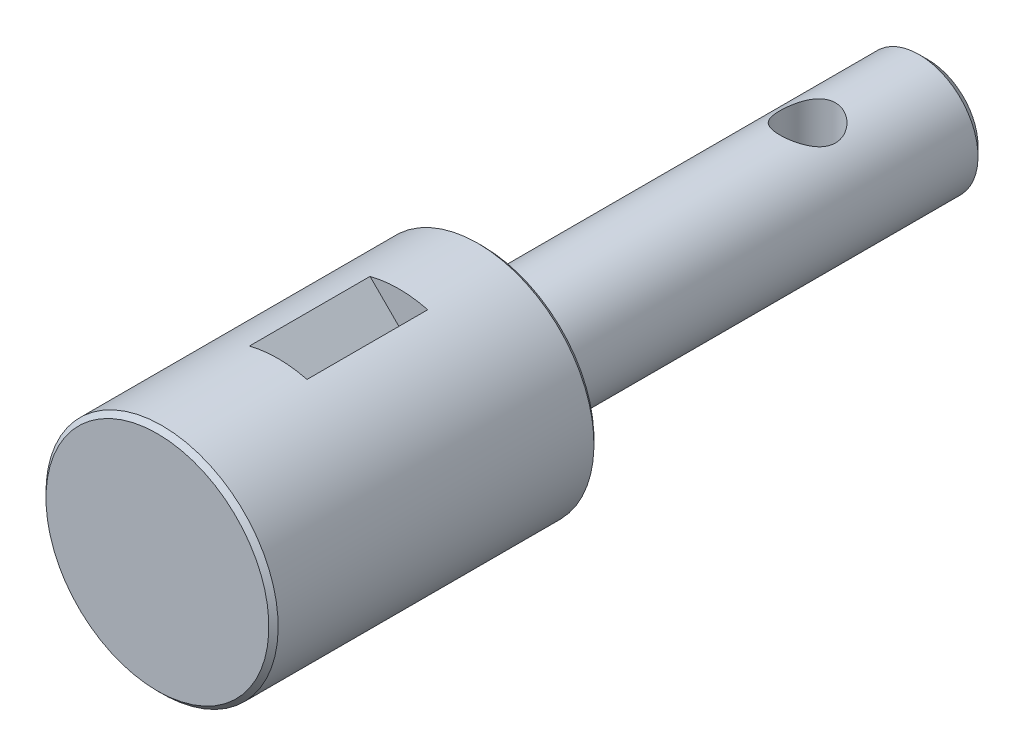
ISO-10303-21;
HEADER;
FILE_DESCRIPTION(('STEP AP214'),'2;1');
FILE_NAME('part.step','',(''),(''),'','','');
FILE_SCHEMA(('AUTOMOTIVE_DESIGN { 1 0 10303 214 1 1 1 1 }'));
ENDSEC;
DATA;
#1=APPLICATION_CONTEXT('core data for automotive mechanical design processes');
#2=APPLICATION_PROTOCOL_DEFINITION('international standard','automotive_design',2000,#1);
#3=PRODUCT_CONTEXT('',#1,'mechanical');
#4=PRODUCT('Part','Part','',(#3));
#5=PRODUCT_RELATED_PRODUCT_CATEGORY('part','',(#4));
#6=PRODUCT_DEFINITION_FORMATION('','',#4);
#7=PRODUCT_DEFINITION_CONTEXT('part definition',#1,'design');
#8=PRODUCT_DEFINITION('design','',#6,#7);
#9=PRODUCT_DEFINITION_SHAPE('','',#8);
#10=(LENGTH_UNIT() NAMED_UNIT(*) SI_UNIT(.MILLI.,.METRE.));
#11=(NAMED_UNIT(*) PLANE_ANGLE_UNIT() SI_UNIT($,.RADIAN.));
#12=(NAMED_UNIT(*) SI_UNIT($,.STERADIAN.) SOLID_ANGLE_UNIT());
#13=UNCERTAINTY_MEASURE_WITH_UNIT(LENGTH_MEASURE(1.E-05),#10,'distance_accuracy_value','');
#14=(GEOMETRIC_REPRESENTATION_CONTEXT(3) GLOBAL_UNCERTAINTY_ASSIGNED_CONTEXT((#13)) GLOBAL_UNIT_ASSIGNED_CONTEXT((#10,
#11,#12)) REPRESENTATION_CONTEXT('',''));
#15=CARTESIAN_POINT('',(0.,0.,0.));
#16=DIRECTION('',(0.,0.,1.));
#17=DIRECTION('',(1.,0.,0.));
#18=AXIS2_PLACEMENT_3D('',#15,#16,#17);
#19=CARTESIAN_POINT('',(0.,0.,-83.));
#20=DIRECTION('',(0.,0.,-1.));
#21=DIRECTION('',(0.,1.,0.));
#22=AXIS2_PLACEMENT_3D('',#19,#20,#21);
#23=CYLINDRICAL_SURFACE('',#22,12.5);
#24=CARTESIAN_POINT('',(0.,0.,-34.5));
#25=DIRECTION('',(0.,0.,-1.));
#26=DIRECTION('',(0.,1.,0.));
#27=AXIS2_PLACEMENT_3D('',#24,#25,#26);
#28=CIRCLE('',#27,12.5);
#29=CARTESIAN_POINT('',(0.,12.5,-34.5));
#30=VERTEX_POINT('',#29);
#31=EDGE_CURVE('E102',#30,#30,#28,.T.);
#32=ORIENTED_EDGE('',*,*,#31,.F.);
#33=EDGE_LOOP('',(#32));
#34=FACE_BOUND('',#33,.T.);
#35=CARTESIAN_POINT('',(0.,0.,-0.5));
#36=DIRECTION('',(0.,0.,-1.));
#37=DIRECTION('',(0.,1.,0.));
#38=AXIS2_PLACEMENT_3D('',#35,#36,#37);
#39=CIRCLE('',#38,12.5);
#40=CARTESIAN_POINT('',(0.,12.5,-0.5));
#41=VERTEX_POINT('',#40);
#42=EDGE_CURVE('E105',#41,#41,#39,.T.);
#43=ORIENTED_EDGE('',*,*,#42,.T.);
#44=EDGE_LOOP('',(#43));
#45=FACE_BOUND('',#44,.T.);
#46=DIRECTION('',(0.,0.,-1.));
#47=VECTOR('',#46,1.);
#48=CARTESIAN_POINT('',(-3.10756202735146,12.1075620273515,-83.));
#49=LINE('',#48,#47);
#50=CARTESIAN_POINT('',(-3.10756202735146,12.1075620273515,-26.));
#51=VERTEX_POINT('',#50);
#52=CARTESIAN_POINT('',(-3.10756202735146,12.1075620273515,-13.));
#53=VERTEX_POINT('',#52);
#54=EDGE_CURVE('E44',#51,#53,#49,.F.);
#55=ORIENTED_EDGE('',*,*,#54,.F.);
#56=CARTESIAN_POINT('',(0.,0.,-26.));
#57=DIRECTION('',(0.,0.,1.));
#58=DIRECTION('',(1.,0.,0.));
#59=AXIS2_PLACEMENT_3D('',#56,#57,#58);
#60=CIRCLE('',#59,12.5);
#61=CARTESIAN_POINT('',(3.10756202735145,12.1075620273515,-26.));
#62=VERTEX_POINT('',#61);
#63=EDGE_CURVE('E11',#51,#62,#60,.F.);
#64=ORIENTED_EDGE('',*,*,#63,.T.);
#65=DIRECTION('',(0.,0.,-1.));
#66=VECTOR('',#65,1.);
#67=CARTESIAN_POINT('',(3.10756202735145,12.1075620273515,-83.));
#68=LINE('',#67,#66);
#69=CARTESIAN_POINT('',(3.10756202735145,12.1075620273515,-13.));
#70=VERTEX_POINT('',#69);
#71=EDGE_CURVE('E60',#70,#62,#68,.T.);
#72=ORIENTED_EDGE('',*,*,#71,.F.);
#73=CARTESIAN_POINT('',(0.,0.,-13.));
#74=DIRECTION('',(0.,0.,1.));
#75=DIRECTION('',(1.,0.,0.));
#76=AXIS2_PLACEMENT_3D('',#73,#74,#75);
#77=CIRCLE('',#76,12.5);
#78=EDGE_CURVE('E111',#53,#70,#77,.F.);
#79=ORIENTED_EDGE('',*,*,#78,.F.);
#80=EDGE_LOOP('',(#55,#64,#72,#79));
#81=FACE_BOUND('',#80,.T.);
#82=ADVANCED_FACE('F31',(#34,#45,#81),#23,.T.);
#83=CARTESIAN_POINT('',(0.,0.,0.));
#84=DIRECTION('',(0.,0.,1.));
#85=DIRECTION('',(0.,-1.,0.));
#86=AXIS2_PLACEMENT_3D('',#83,#84,#85);
#87=PLANE('',#86);
#88=CARTESIAN_POINT('',(0.,0.,0.));
#89=DIRECTION('',(0.,0.,-1.));
#90=DIRECTION('',(0.,1.,0.));
#91=AXIS2_PLACEMENT_3D('',#88,#89,#90);
#92=CIRCLE('',#91,12.);
#93=CARTESIAN_POINT('',(0.,12.,0.));
#94=VERTEX_POINT('',#93);
#95=EDGE_CURVE('E108',#94,#94,#92,.T.);
#96=ORIENTED_EDGE('',*,*,#95,.F.);
#97=EDGE_LOOP('',(#96));
#98=FACE_BOUND('',#97,.T.);
#99=ADVANCED_FACE('F33',(#98),#87,.T.);
#100=CARTESIAN_POINT('',(0.,0.,-0.5));
#101=DIRECTION('',(0.,0.,-1.));
#102=DIRECTION('',(0.,1.,0.));
#103=AXIS2_PLACEMENT_3D('',#100,#101,#102);
#104=CONICAL_SURFACE('',#103,12.5,0.785398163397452);
#105=ORIENTED_EDGE('',*,*,#95,.T.);
#106=EDGE_LOOP('',(#105));
#107=FACE_BOUND('',#106,.T.);
#108=ORIENTED_EDGE('',*,*,#42,.F.);
#109=EDGE_LOOP('',(#108));
#110=FACE_BOUND('',#109,.T.);
#111=ADVANCED_FACE('F155',(#107,#110),#104,.T.);
#112=CARTESIAN_POINT('',(0.,0.,-35.));
#113=DIRECTION('',(0.,0.,1.));
#114=DIRECTION('',(0.,-1.,0.));
#115=AXIS2_PLACEMENT_3D('',#112,#113,#114);
#116=CONICAL_SURFACE('',#115,12.,0.785398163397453);
#117=ORIENTED_EDGE('',*,*,#31,.T.);
#118=EDGE_LOOP('',(#117));
#119=FACE_BOUND('',#118,.T.);
#120=CARTESIAN_POINT('',(0.,0.,-35.));
#121=DIRECTION('',(0.,0.,-1.));
#122=DIRECTION('',(0.,1.,0.));
#123=AXIS2_PLACEMENT_3D('',#120,#121,#122);
#124=CIRCLE('',#123,12.);
#125=CARTESIAN_POINT('',(0.,12.,-35.));
#126=VERTEX_POINT('',#125);
#127=EDGE_CURVE('E99',#126,#126,#124,.T.);
#128=ORIENTED_EDGE('',*,*,#127,.F.);
#129=EDGE_LOOP('',(#128));
#130=FACE_BOUND('',#129,.T.);
#131=ADVANCED_FACE('F160',(#119,#130),#116,.T.);
#132=CARTESIAN_POINT('',(0.,12.,-35.));
#133=DIRECTION('',(0.,0.,-1.));
#134=DIRECTION('',(0.,1.,0.));
#135=AXIS2_PLACEMENT_3D('',#132,#133,#134);
#136=PLANE('',#135);
#137=ORIENTED_EDGE('',*,*,#127,.T.);
#138=EDGE_LOOP('',(#137));
#139=FACE_BOUND('',#138,.T.);
#140=CARTESIAN_POINT('',(0.,0.,-35.));
#141=DIRECTION('',(0.,0.,-1.));
#142=DIRECTION('',(0.,1.,0.));
#143=AXIS2_PLACEMENT_3D('',#140,#141,#142);
#144=CIRCLE('',#143,6.34999999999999);
#145=CARTESIAN_POINT('',(0.,6.34999999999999,-35.));
#146=VERTEX_POINT('',#145);
#147=EDGE_CURVE('E96',#146,#146,#144,.T.);
#148=ORIENTED_EDGE('',*,*,#147,.F.);
#149=EDGE_LOOP('',(#148));
#150=FACE_BOUND('',#149,.T.);
#151=ADVANCED_FACE('F146',(#139,#150),#136,.T.);
#152=CARTESIAN_POINT('',(0.,0.,-83.));
#153=DIRECTION('',(0.,0.,-1.));
#154=DIRECTION('',(0.,1.,0.));
#155=AXIS2_PLACEMENT_3D('',#152,#153,#154);
#156=CYLINDRICAL_SURFACE('',#155,6.34999999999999);
#157=CARTESIAN_POINT('',(0.,6.34999999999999,-67.));
#158=CARTESIAN_POINT('',(0.158735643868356,6.34999131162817,-67.0000104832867));
#159=CARTESIAN_POINT('',(0.317696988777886,6.34398210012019,-67.0126737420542));
#160=CARTESIAN_POINT('',(0.630982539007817,6.32053556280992,-67.06280032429));
#161=CARTESIAN_POINT('',(0.78529595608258,6.30307351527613,-67.1003172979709));
#162=CARTESIAN_POINT('',(1.0842690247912,6.25856360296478,-67.1983909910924));
#163=CARTESIAN_POINT('',(1.22896239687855,6.23155157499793,-67.2588616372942));
#164=CARTESIAN_POINT('',(1.5059653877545,6.17047124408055,-67.4007104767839));
#165=CARTESIAN_POINT('',(1.63827688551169,6.1364040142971,-67.4820854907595));
#166=CARTESIAN_POINT('',(1.89506470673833,6.06218401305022,-67.6686289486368));
#167=CARTESIAN_POINT('',(2.01869357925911,6.02179791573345,-67.7748705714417));
#168=CARTESIAN_POINT('',(2.2471345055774,5.94033863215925,-68.0058035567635));
#169=CARTESIAN_POINT('',(2.35193384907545,5.8992650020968,-68.1305072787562));
#170=CARTESIAN_POINT('',(2.54682621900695,5.81791039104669,-68.4050648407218));
#171=CARTESIAN_POINT('',(2.63545600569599,5.77786853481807,-68.5560461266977));
#172=CARTESIAN_POINT('',(2.74809115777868,5.72470256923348,-68.7934763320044));
#173=CARTESIAN_POINT('',(2.78225974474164,5.70812542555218,-68.8744765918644));
#174=CARTESIAN_POINT('',(2.84348823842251,5.67787297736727,-69.0396280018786));
#175=CARTESIAN_POINT('',(2.87055214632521,5.66419604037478,-69.1237773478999));
#176=CARTESIAN_POINT('',(2.9159220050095,5.6409673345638,-69.2897986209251));
#177=CARTESIAN_POINT('',(2.93463412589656,5.63122717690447,-69.3715334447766));
#178=CARTESIAN_POINT('',(2.96517735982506,5.6152044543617,-69.5365762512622));
#179=CARTESIAN_POINT('',(2.9770119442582,5.60892014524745,-69.6198834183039));
#180=CARTESIAN_POINT('',(2.99363646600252,5.60006542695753,-69.7873623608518));
#181=CARTESIAN_POINT('',(2.99842966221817,5.59749329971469,-69.8715337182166));
#182=CARTESIAN_POINT('',(3.00091788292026,5.59615798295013,-70.0399844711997));
#183=CARTESIAN_POINT('',(2.99861346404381,5.59739449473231,-70.1242638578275));
#184=CARTESIAN_POINT('',(2.98228707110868,5.60612787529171,-70.3586473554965));
#185=CARTESIAN_POINT('',(2.96044454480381,5.61779971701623,-70.5081386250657));
#186=CARTESIAN_POINT('',(2.89501216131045,5.65178886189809,-70.80091706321));
#187=CARTESIAN_POINT('',(2.85141651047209,5.67410900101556,-70.9442025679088));
#188=CARTESIAN_POINT('',(2.74288007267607,5.72737541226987,-71.2246352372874));
#189=CARTESIAN_POINT('',(2.67746822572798,5.758509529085,-71.3615633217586));
#190=CARTESIAN_POINT('',(2.52750090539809,5.82588930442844,-71.6231136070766));
#191=CARTESIAN_POINT('',(2.44293700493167,5.86213721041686,-71.7477303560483));
#192=CARTESIAN_POINT('',(2.24603652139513,5.94055944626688,-71.9957713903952));
#193=CARTESIAN_POINT('',(2.13165370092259,5.98294371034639,-72.1175105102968));
#194=CARTESIAN_POINT('',(1.88382332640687,6.06553935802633,-72.3407340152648));
#195=CARTESIAN_POINT('',(1.75036848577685,6.10574990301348,-72.4422106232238));
#196=CARTESIAN_POINT('',(1.46180089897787,6.1813162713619,-72.6255310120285));
#197=CARTESIAN_POINT('',(1.30606552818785,6.21643476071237,-72.7065002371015));
#198=CARTESIAN_POINT('',(0.981099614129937,6.27591792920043,-72.8404697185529));
#199=CARTESIAN_POINT('',(0.811878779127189,6.30029026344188,-72.8934898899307));
#200=CARTESIAN_POINT('',(0.478650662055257,6.33397698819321,-72.9660934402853));
#201=CARTESIAN_POINT('',(0.315236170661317,6.34430139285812,-72.9879260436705));
#202=CARTESIAN_POINT('',(-0.0132401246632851,6.35210748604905,-73.0044690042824));
#203=CARTESIAN_POINT('',(-0.178301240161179,6.34959433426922,-72.9991902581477));
#204=CARTESIAN_POINT('',(-0.493581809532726,6.33262500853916,-72.963082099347));
#205=CARTESIAN_POINT('',(-0.644051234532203,6.31898607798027,-72.9340006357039));
#206=CARTESIAN_POINT('',(-0.93771982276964,6.28212499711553,-72.8537450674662));
#207=CARTESIAN_POINT('',(-1.08091814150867,6.25890173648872,-72.8025684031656));
#208=CARTESIAN_POINT('',(-1.36096532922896,6.20413258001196,-72.6780544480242));
#209=CARTESIAN_POINT('',(-1.49748886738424,6.17235515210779,-72.6040908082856));
#210=CARTESIAN_POINT('',(-1.75666682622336,6.103656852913,-72.4367891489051));
#211=CARTESIAN_POINT('',(-1.87931512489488,6.06673372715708,-72.3434426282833));
#212=CARTESIAN_POINT('',(-2.11888943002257,5.98749695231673,-72.1303196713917));
#213=CARTESIAN_POINT('',(-2.23431643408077,5.94499681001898,-72.0089239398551));
#214=CARTESIAN_POINT('',(-2.44375164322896,5.86202140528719,-71.7481599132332));
#215=CARTESIAN_POINT('',(-2.53774887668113,5.82154718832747,-71.6087824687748));
#216=CARTESIAN_POINT('',(-2.70463547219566,5.74596844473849,-71.3096827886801));
#217=CARTESIAN_POINT('',(-2.77667149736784,5.71110126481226,-71.149419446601));
#218=CARTESIAN_POINT('',(-2.89199593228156,5.65359008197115,-70.8168485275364));
#219=CARTESIAN_POINT('',(-2.93531709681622,5.63093215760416,-70.6445549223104));
#220=CARTESIAN_POINT('',(-2.98833110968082,5.60296296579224,-70.3097268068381));
#221=CARTESIAN_POINT('',(-3.0007349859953,5.59625585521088,-70.1477390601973));
#222=CARTESIAN_POINT('',(-2.99919821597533,5.5970815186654,-69.8239486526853));
#223=CARTESIAN_POINT('',(-2.98526553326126,5.6046099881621,-69.6621459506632));
#224=CARTESIAN_POINT('',(-2.93391097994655,5.63164218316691,-69.3562762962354));
#225=CARTESIAN_POINT('',(-2.8983673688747,5.65018584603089,-69.2117994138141));
#226=CARTESIAN_POINT('',(-2.80694513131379,5.69615317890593,-68.9309420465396));
#227=CARTESIAN_POINT('',(-2.75106038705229,5.72357952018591,-68.7945640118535));
#228=CARTESIAN_POINT('',(-2.61632375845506,5.78646860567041,-68.5237790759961));
#229=CARTESIAN_POINT('',(-2.53618984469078,5.8223450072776,-68.3901087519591));
#230=CARTESIAN_POINT('',(-2.35675969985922,5.89725587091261,-68.1372777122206));
#231=CARTESIAN_POINT('',(-2.25745430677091,5.93629183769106,-68.0181239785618));
#232=CARTESIAN_POINT('',(-2.0303859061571,6.01797799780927,-67.7848906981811));
#233=CARTESIAN_POINT('',(-1.9007384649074,6.06058247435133,-67.6726235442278));
#234=CARTESIAN_POINT('',(-1.62298549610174,6.14078504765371,-67.471105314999));
#235=CARTESIAN_POINT('',(-1.47487109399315,6.17838071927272,-67.3818653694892));
#236=CARTESIAN_POINT('',(-1.24202481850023,6.22785646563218,-67.2678129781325));
#237=CARTESIAN_POINT('',(-1.16272476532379,6.24318215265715,-67.2331244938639));
#238=CARTESIAN_POINT('',(-1.00102034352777,6.27113792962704,-67.1706082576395));
#239=CARTESIAN_POINT('',(-0.9186175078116,6.28376933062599,-67.1427771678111));
#240=CARTESIAN_POINT('',(-0.751519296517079,6.30593452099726,-67.0943552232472));
#241=CARTESIAN_POINT('',(-0.666829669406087,6.31547541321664,-67.073747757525));
#242=CARTESIAN_POINT('',(-0.495718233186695,6.33120329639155,-67.0399560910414));
#243=CARTESIAN_POINT('',(-0.409297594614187,6.33739247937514,-67.0267670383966));
#244=CARTESIAN_POINT('',(-0.268909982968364,6.34452974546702,-67.0115919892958));
#245=CARTESIAN_POINT('',(-0.21524263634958,6.34657804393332,-67.0072482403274));
#246=CARTESIAN_POINT('',(-0.107725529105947,6.34931466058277,-67.0014504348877));
#247=CARTESIAN_POINT('',(-0.053875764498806,6.35000294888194,-66.9999964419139));
#248=CARTESIAN_POINT('',(0.,6.34999999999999,-67.));
#249=B_SPLINE_CURVE_WITH_KNOTS('',3,(#157,#158,#159,#160,#161,#162,#163,#164,#165,#166,#167,
#168,#169,#170,#171,#172,#173,#174,#175,#176,#177,#178,#179,#180,#181,#182,#183,#184,#185,#186,
#187,#188,#189,#190,#191,#192,#193,#194,#195,#196,#197,#198,#199,#200,#201,#202,#203,#204,#205,
#206,#207,#208,#209,#210,#211,#212,#213,#214,#215,#216,#217,#218,#219,#220,#221,#222,#223,#224,
#225,#226,#227,#228,#229,#230,#231,#232,#233,#234,#235,#236,#237,#238,#239,#240,#241,#242,#243,
#244,#245,#246,#247,#248),.UNSPECIFIED.,.T.,.F.,(4,2,2,2,2,2,2,2,2,2,2,2,2,2,2,2,2,2,2,2,2,2,2,
2,2,2,2,2,2,2,2,2,2,2,2,2,2,2,2,2,2,2,2,2,2,4),(0.,0.475997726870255,0.953026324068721,
1.42828352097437,1.90346847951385,2.405132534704,2.90713396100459,3.44289983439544,
3.71097177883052,3.97889242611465,4.23178157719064,4.48454297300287,4.73718734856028,
4.98981191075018,5.44206841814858,5.89444544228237,6.35730164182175,6.82036189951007,
7.33510031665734,7.85003592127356,8.38419883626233,8.91798061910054,9.41089442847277,
9.9036101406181,10.3630820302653,10.8226071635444,11.2961009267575,11.7698027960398,
12.2859764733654,12.8024138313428,13.336915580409,13.8708065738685,14.3559144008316,
14.8408755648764,15.2887410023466,15.7367412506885,16.2145869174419,16.6926615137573,
17.2203903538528,17.7483737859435,18.0117778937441,18.275053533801,18.5377197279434,
18.8002139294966,18.9617666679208,19.1233229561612),.UNSPECIFIED.);
#250=CARTESIAN_POINT('',(0.,6.34999999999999,-67.));
#251=VERTEX_POINT('',#250);
#252=EDGE_CURVE('E35',#251,#251,#249,.T.);
#253=ORIENTED_EDGE('',*,*,#252,.F.);
#254=EDGE_LOOP('',(#253));
#255=FACE_BOUND('',#254,.T.);
#256=CARTESIAN_POINT('',(0.,-6.34999999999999,-67.));
#257=CARTESIAN_POINT('',(-0.158735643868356,-6.34999131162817,-67.0000104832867));
#258=CARTESIAN_POINT('',(-0.317696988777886,-6.34398210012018,-67.0126737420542));
#259=CARTESIAN_POINT('',(-0.630982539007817,-6.32053556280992,-67.06280032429));
#260=CARTESIAN_POINT('',(-0.78529595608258,-6.30307351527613,-67.1003172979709));
#261=CARTESIAN_POINT('',(-1.0842690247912,-6.25856360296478,-67.1983909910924));
#262=CARTESIAN_POINT('',(-1.22896239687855,-6.23155157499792,-67.2588616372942));
#263=CARTESIAN_POINT('',(-1.5059653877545,-6.17047124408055,-67.4007104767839));
#264=CARTESIAN_POINT('',(-1.63827688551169,-6.1364040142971,-67.4820854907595));
#265=CARTESIAN_POINT('',(-1.89506470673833,-6.06218401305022,-67.6686289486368));
#266=CARTESIAN_POINT('',(-2.01869357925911,-6.02179791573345,-67.7748705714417));
#267=CARTESIAN_POINT('',(-2.2471345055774,-5.94033863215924,-68.0058035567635));
#268=CARTESIAN_POINT('',(-2.35193384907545,-5.89926500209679,-68.1305072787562));
#269=CARTESIAN_POINT('',(-2.54682621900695,-5.81791039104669,-68.4050648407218));
#270=CARTESIAN_POINT('',(-2.63545600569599,-5.77786853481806,-68.5560461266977));
#271=CARTESIAN_POINT('',(-2.74809115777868,-5.72470256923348,-68.7934763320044));
#272=CARTESIAN_POINT('',(-2.78225974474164,-5.70812542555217,-68.8744765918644));
#273=CARTESIAN_POINT('',(-2.84348823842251,-5.67787297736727,-69.0396280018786));
#274=CARTESIAN_POINT('',(-2.87055214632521,-5.66419604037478,-69.1237773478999));
#275=CARTESIAN_POINT('',(-2.9159220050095,-5.6409673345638,-69.2897986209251));
#276=CARTESIAN_POINT('',(-2.93463412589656,-5.63122717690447,-69.3715334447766));
#277=CARTESIAN_POINT('',(-2.96517735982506,-5.6152044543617,-69.5365762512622));
#278=CARTESIAN_POINT('',(-2.9770119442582,-5.60892014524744,-69.6198834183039));
#279=CARTESIAN_POINT('',(-2.99363646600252,-5.60006542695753,-69.7873623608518));
#280=CARTESIAN_POINT('',(-2.99842966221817,-5.59749329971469,-69.8715337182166));
#281=CARTESIAN_POINT('',(-3.00091788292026,-5.59615798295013,-70.0399844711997));
#282=CARTESIAN_POINT('',(-2.99861346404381,-5.59739449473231,-70.1242638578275));
#283=CARTESIAN_POINT('',(-2.98228707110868,-5.60612787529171,-70.3586473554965));
#284=CARTESIAN_POINT('',(-2.96044454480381,-5.61779971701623,-70.5081386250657));
#285=CARTESIAN_POINT('',(-2.89501216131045,-5.65178886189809,-70.80091706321));
#286=CARTESIAN_POINT('',(-2.85141651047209,-5.67410900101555,-70.9442025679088));
#287=CARTESIAN_POINT('',(-2.74288007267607,-5.72737541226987,-71.2246352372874));
#288=CARTESIAN_POINT('',(-2.67746822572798,-5.75850952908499,-71.3615633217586));
#289=CARTESIAN_POINT('',(-2.52750090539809,-5.82588930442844,-71.6231136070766));
#290=CARTESIAN_POINT('',(-2.44293700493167,-5.86213721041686,-71.7477303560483));
#291=CARTESIAN_POINT('',(-2.24603652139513,-5.94055944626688,-71.9957713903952));
#292=CARTESIAN_POINT('',(-2.13165370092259,-5.98294371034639,-72.1175105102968));
#293=CARTESIAN_POINT('',(-1.88382332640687,-6.06553935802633,-72.3407340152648));
#294=CARTESIAN_POINT('',(-1.75036848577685,-6.10574990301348,-72.4422106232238));
#295=CARTESIAN_POINT('',(-1.46180089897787,-6.18131627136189,-72.6255310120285));
#296=CARTESIAN_POINT('',(-1.30606552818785,-6.21643476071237,-72.7065002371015));
#297=CARTESIAN_POINT('',(-0.981099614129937,-6.27591792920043,-72.8404697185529));
#298=CARTESIAN_POINT('',(-0.811878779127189,-6.30029026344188,-72.8934898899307));
#299=CARTESIAN_POINT('',(-0.478650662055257,-6.33397698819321,-72.9660934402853));
#300=CARTESIAN_POINT('',(-0.315236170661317,-6.34430139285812,-72.9879260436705));
#301=CARTESIAN_POINT('',(0.0132401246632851,-6.35210748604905,-73.0044690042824));
#302=CARTESIAN_POINT('',(0.178301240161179,-6.34959433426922,-72.9991902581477));
#303=CARTESIAN_POINT('',(0.493581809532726,-6.33262500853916,-72.963082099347));
#304=CARTESIAN_POINT('',(0.644051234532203,-6.31898607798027,-72.9340006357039));
#305=CARTESIAN_POINT('',(0.93771982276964,-6.28212499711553,-72.8537450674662));
#306=CARTESIAN_POINT('',(1.08091814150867,-6.25890173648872,-72.8025684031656));
#307=CARTESIAN_POINT('',(1.36096532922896,-6.20413258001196,-72.6780544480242));
#308=CARTESIAN_POINT('',(1.49748886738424,-6.17235515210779,-72.6040908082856));
#309=CARTESIAN_POINT('',(1.75666682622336,-6.103656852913,-72.4367891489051));
#310=CARTESIAN_POINT('',(1.87931512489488,-6.06673372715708,-72.3434426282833));
#311=CARTESIAN_POINT('',(2.11888943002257,-5.98749695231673,-72.1303196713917));
#312=CARTESIAN_POINT('',(2.23431643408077,-5.94499681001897,-72.0089239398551));
#313=CARTESIAN_POINT('',(2.44375164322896,-5.86202140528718,-71.7481599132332));
#314=CARTESIAN_POINT('',(2.53774887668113,-5.82154718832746,-71.6087824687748));
#315=CARTESIAN_POINT('',(2.70463547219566,-5.74596844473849,-71.3096827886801));
#316=CARTESIAN_POINT('',(2.77667149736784,-5.71110126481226,-71.149419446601));
#317=CARTESIAN_POINT('',(2.89199593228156,-5.65359008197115,-70.8168485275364));
#318=CARTESIAN_POINT('',(2.93531709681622,-5.63093215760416,-70.6445549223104));
#319=CARTESIAN_POINT('',(2.98833110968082,-5.60296296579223,-70.3097268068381));
#320=CARTESIAN_POINT('',(3.0007349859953,-5.59625585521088,-70.1477390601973));
#321=CARTESIAN_POINT('',(2.99919821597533,-5.59708151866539,-69.8239486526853));
#322=CARTESIAN_POINT('',(2.98526553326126,-5.6046099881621,-69.6621459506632));
#323=CARTESIAN_POINT('',(2.93391097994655,-5.63164218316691,-69.3562762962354));
#324=CARTESIAN_POINT('',(2.8983673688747,-5.65018584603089,-69.2117994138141));
#325=CARTESIAN_POINT('',(2.80694513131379,-5.69615317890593,-68.9309420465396));
#326=CARTESIAN_POINT('',(2.75106038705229,-5.7235795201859,-68.7945640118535));
#327=CARTESIAN_POINT('',(2.61632375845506,-5.78646860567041,-68.5237790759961));
#328=CARTESIAN_POINT('',(2.53618984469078,-5.82234500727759,-68.3901087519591));
#329=CARTESIAN_POINT('',(2.35675969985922,-5.8972558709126,-68.1372777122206));
#330=CARTESIAN_POINT('',(2.25745430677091,-5.93629183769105,-68.0181239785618));
#331=CARTESIAN_POINT('',(2.0303859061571,-6.01797799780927,-67.7848906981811));
#332=CARTESIAN_POINT('',(1.9007384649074,-6.06058247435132,-67.6726235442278));
#333=CARTESIAN_POINT('',(1.62298549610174,-6.14078504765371,-67.471105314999));
#334=CARTESIAN_POINT('',(1.47487109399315,-6.17838071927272,-67.3818653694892));
#335=CARTESIAN_POINT('',(1.24202481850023,-6.22785646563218,-67.2678129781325));
#336=CARTESIAN_POINT('',(1.1627247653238,-6.24318215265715,-67.2331244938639));
#337=CARTESIAN_POINT('',(1.00102034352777,-6.27113792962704,-67.1706082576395));
#338=CARTESIAN_POINT('',(0.9186175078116,-6.28376933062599,-67.1427771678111));
#339=CARTESIAN_POINT('',(0.751519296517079,-6.30593452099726,-67.0943552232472));
#340=CARTESIAN_POINT('',(0.666829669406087,-6.31547541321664,-67.073747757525));
#341=CARTESIAN_POINT('',(0.495718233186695,-6.33120329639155,-67.0399560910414));
#342=CARTESIAN_POINT('',(0.409297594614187,-6.33739247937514,-67.0267670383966));
#343=CARTESIAN_POINT('',(0.268909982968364,-6.34452974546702,-67.0115919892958));
#344=CARTESIAN_POINT('',(0.21524263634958,-6.34657804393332,-67.0072482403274));
#345=CARTESIAN_POINT('',(0.107725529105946,-6.34931466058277,-67.0014504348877));
#346=CARTESIAN_POINT('',(0.0538757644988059,-6.35000294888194,-66.9999964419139));
#347=CARTESIAN_POINT('',(0.,-6.34999999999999,-67.));
#348=B_SPLINE_CURVE_WITH_KNOTS('',3,(#256,#257,#258,#259,#260,#261,#262,#263,#264,#265,#266,
#267,#268,#269,#270,#271,#272,#273,#274,#275,#276,#277,#278,#279,#280,#281,#282,#283,#284,#285,
#286,#287,#288,#289,#290,#291,#292,#293,#294,#295,#296,#297,#298,#299,#300,#301,#302,#303,#304,
#305,#306,#307,#308,#309,#310,#311,#312,#313,#314,#315,#316,#317,#318,#319,#320,#321,#322,#323,
#324,#325,#326,#327,#328,#329,#330,#331,#332,#333,#334,#335,#336,#337,#338,#339,#340,#341,#342,
#343,#344,#345,#346,#347),.UNSPECIFIED.,.T.,.F.,(4,2,2,2,2,2,2,2,2,2,2,2,2,2,2,2,2,2,2,2,2,2,2,
2,2,2,2,2,2,2,2,2,2,2,2,2,2,2,2,2,2,2,2,2,2,4),(0.,0.475997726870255,0.953026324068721,
1.42828352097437,1.90346847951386,2.405132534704,2.90713396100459,3.44289983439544,
3.71097177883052,3.97889242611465,4.23178157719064,4.48454297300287,4.73718734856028,
4.98981191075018,5.44206841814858,5.89444544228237,6.35730164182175,6.82036189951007,
7.33510031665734,7.85003592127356,8.38419883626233,8.91798061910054,9.41089442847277,
9.9036101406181,10.3630820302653,10.8226071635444,11.2961009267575,11.7698027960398,
12.2859764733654,12.8024138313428,13.336915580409,13.8708065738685,14.3559144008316,
14.8408755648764,15.2887410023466,15.7367412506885,16.2145869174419,16.6926615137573,
17.2203903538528,17.7483737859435,18.0117778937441,18.275053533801,18.5377197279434,
18.8002139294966,18.9617666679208,19.1233229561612),.UNSPECIFIED.);
#349=CARTESIAN_POINT('',(0.,-6.34999999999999,-67.));
#350=VERTEX_POINT('',#349);
#351=EDGE_CURVE('E114',#350,#350,#348,.T.);
#352=ORIENTED_EDGE('',*,*,#351,.F.);
#353=EDGE_LOOP('',(#352));
#354=FACE_BOUND('',#353,.T.);
#355=ORIENTED_EDGE('',*,*,#147,.T.);
#356=EDGE_LOOP('',(#355));
#357=FACE_BOUND('',#356,.T.);
#358=CARTESIAN_POINT('',(0.,0.,-82.));
#359=DIRECTION('',(0.,0.,-1.));
#360=DIRECTION('',(0.,1.,0.));
#361=AXIS2_PLACEMENT_3D('',#358,#359,#360);
#362=CIRCLE('',#361,6.34999999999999);
#363=CARTESIAN_POINT('',(0.,6.34999999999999,-82.));
#364=VERTEX_POINT('',#363);
#365=EDGE_CURVE('E93',#364,#364,#362,.T.);
#366=ORIENTED_EDGE('',*,*,#365,.F.);
#367=EDGE_LOOP('',(#366));
#368=FACE_BOUND('',#367,.T.);
#369=ADVANCED_FACE('F118',(#255,#354,#357,#368),#156,.T.);
#370=CARTESIAN_POINT('',(0.,0.,-83.));
#371=DIRECTION('',(0.,0.,1.));
#372=DIRECTION('',(0.,-1.,0.));
#373=AXIS2_PLACEMENT_3D('',#370,#371,#372);
#374=CONICAL_SURFACE('',#373,5.34999999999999,0.785398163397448);
#375=ORIENTED_EDGE('',*,*,#365,.T.);
#376=EDGE_LOOP('',(#375));
#377=FACE_BOUND('',#376,.T.);
#378=CARTESIAN_POINT('',(0.,0.,-83.));
#379=DIRECTION('',(0.,0.,-1.));
#380=DIRECTION('',(0.,1.,0.));
#381=AXIS2_PLACEMENT_3D('',#378,#379,#380);
#382=CIRCLE('',#381,5.34999999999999);
#383=CARTESIAN_POINT('',(0.,5.34999999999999,-83.));
#384=VERTEX_POINT('',#383);
#385=EDGE_CURVE('E84',#384,#384,#382,.T.);
#386=ORIENTED_EDGE('',*,*,#385,.F.);
#387=EDGE_LOOP('',(#386));
#388=FACE_BOUND('',#387,.T.);
#389=ADVANCED_FACE('F139',(#377,#388),#374,.T.);
#390=CARTESIAN_POINT('',(0.,5.34999999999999,-83.));
#391=DIRECTION('',(0.,0.,-1.));
#392=DIRECTION('',(0.,1.,0.));
#393=AXIS2_PLACEMENT_3D('',#390,#391,#392);
#394=PLANE('',#393);
#395=ORIENTED_EDGE('',*,*,#385,.T.);
#396=EDGE_LOOP('',(#395));
#397=FACE_BOUND('',#396,.T.);
#398=ADVANCED_FACE('F137',(#397),#394,.T.);
#399=CARTESIAN_POINT('',(0.,8.99999999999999,-26.));
#400=DIRECTION('',(-0.707106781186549,-0.707106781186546,0.));
#401=DIRECTION('',(0.707106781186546,-0.707106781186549,0.));
#402=AXIS2_PLACEMENT_3D('',#399,#400,#401);
#403=PLANE('',#402);
#404=ORIENTED_EDGE('',*,*,#54,.T.);
#405=DIRECTION('',(0.707106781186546,-0.707106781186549,0.));
#406=VECTOR('',#405,1.);
#407=CARTESIAN_POINT('',(0.,8.99999999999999,-13.));
#408=LINE('',#407,#406);
#409=CARTESIAN_POINT('',(0.,8.99999999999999,-13.));
#410=VERTEX_POINT('',#409);
#411=EDGE_CURVE('E52',#53,#410,#408,.T.);
#412=ORIENTED_EDGE('',*,*,#411,.T.);
#413=DIRECTION('',(0.,0.,1.));
#414=VECTOR('',#413,1.);
#415=CARTESIAN_POINT('',(0.,8.99999999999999,-26.));
#416=LINE('',#415,#414);
#417=CARTESIAN_POINT('',(0.,8.99999999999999,-26.));
#418=VERTEX_POINT('',#417);
#419=EDGE_CURVE('E82',#418,#410,#416,.T.);
#420=ORIENTED_EDGE('',*,*,#419,.F.);
#421=DIRECTION('',(0.707106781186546,-0.707106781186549,0.));
#422=VECTOR('',#421,1.);
#423=CARTESIAN_POINT('',(0.,8.99999999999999,-26.));
#424=LINE('',#423,#422);
#425=EDGE_CURVE('E73',#51,#418,#424,.T.);
#426=ORIENTED_EDGE('',*,*,#425,.F.);
#427=EDGE_LOOP('',(#404,#412,#420,#426));
#428=FACE_BOUND('',#427,.T.);
#429=ADVANCED_FACE('F83',(#428),#403,.F.);
#430=CARTESIAN_POINT('',(3.85339720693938,12.8533972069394,-26.));
#431=DIRECTION('',(0.70710678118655,-0.707106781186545,0.));
#432=DIRECTION('',(0.707106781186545,0.70710678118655,0.));
#433=AXIS2_PLACEMENT_3D('',#430,#431,#432);
#434=PLANE('',#433);
#435=ORIENTED_EDGE('',*,*,#71,.T.);
#436=DIRECTION('',(0.707106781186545,0.70710678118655,0.));
#437=VECTOR('',#436,1.);
#438=CARTESIAN_POINT('',(3.85339720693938,12.8533972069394,-26.));
#439=LINE('',#438,#437);
#440=EDGE_CURVE('E76',#418,#62,#439,.T.);
#441=ORIENTED_EDGE('',*,*,#440,.F.);
#442=ORIENTED_EDGE('',*,*,#419,.T.);
#443=DIRECTION('',(0.707106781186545,0.70710678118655,0.));
#444=VECTOR('',#443,1.);
#445=CARTESIAN_POINT('',(3.85339720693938,12.8533972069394,-13.));
#446=LINE('',#445,#444);
#447=EDGE_CURVE('E79',#410,#70,#446,.T.);
#448=ORIENTED_EDGE('',*,*,#447,.T.);
#449=EDGE_LOOP('',(#435,#441,#442,#448));
#450=FACE_BOUND('',#449,.T.);
#451=ADVANCED_FACE('F86',(#450),#434,.F.);
#452=CARTESIAN_POINT('',(0.,8.99999999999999,-26.));
#453=DIRECTION('',(0.,0.,1.));
#454=DIRECTION('',(1.,0.,0.));
#455=AXIS2_PLACEMENT_3D('',#452,#453,#454);
#456=PLANE('',#455);
#457=ORIENTED_EDGE('',*,*,#425,.T.);
#458=ORIENTED_EDGE('',*,*,#440,.T.);
#459=ORIENTED_EDGE('',*,*,#63,.F.);
#460=EDGE_LOOP('',(#457,#458,#459));
#461=FACE_BOUND('',#460,.T.);
#462=ADVANCED_FACE('F75',(#461),#456,.T.);
#463=CARTESIAN_POINT('',(0.,8.99999999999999,-13.));
#464=DIRECTION('',(0.,0.,1.));
#465=DIRECTION('',(1.,0.,0.));
#466=AXIS2_PLACEMENT_3D('',#463,#464,#465);
#467=PLANE('',#466);
#468=ORIENTED_EDGE('',*,*,#78,.T.);
#469=ORIENTED_EDGE('',*,*,#447,.F.);
#470=ORIENTED_EDGE('',*,*,#411,.F.);
#471=EDGE_LOOP('',(#468,#469,#470));
#472=FACE_BOUND('',#471,.T.);
#473=ADVANCED_FACE('F126',(#472),#467,.F.);
#474=CARTESIAN_POINT('',(0.,-10.,-70.));
#475=DIRECTION('',(0.,1.,0.));
#476=DIRECTION('',(0.,0.,1.));
#477=AXIS2_PLACEMENT_3D('',#474,#475,#476);
#478=CYLINDRICAL_SURFACE('',#477,3.);
#479=ORIENTED_EDGE('',*,*,#252,.T.);
#480=EDGE_LOOP('',(#479));
#481=FACE_BOUND('',#480,.T.);
#482=ORIENTED_EDGE('',*,*,#351,.T.);
#483=EDGE_LOOP('',(#482));
#484=FACE_BOUND('',#483,.T.);
#485=ADVANCED_FACE('F122',(#481,#484),#478,.F.);
#486=CLOSED_SHELL('',(#82,#99,#111,#131,#151,#369,#389,#398,#429,#451,#462,#473,#485));
#487=MANIFOLD_SOLID_BREP('B2',#486);
#488=ADVANCED_BREP_SHAPE_REPRESENTATION('',(#18,#487),#14);
#489=SHAPE_DEFINITION_REPRESENTATION(#9,#488);
ENDSEC;
END-ISO-10303-21;
